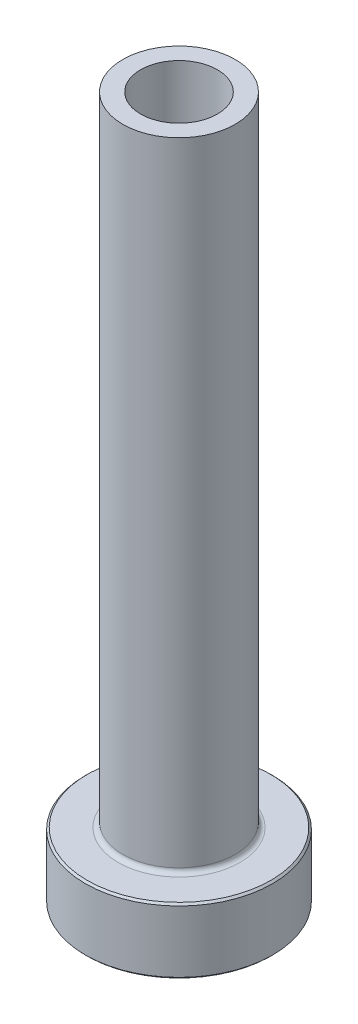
from build123d import *

# Parameters (mm, degrees)
FILLET1_R     = 0.5
CHAMFER1_SIZE = 0.2
CHAMFER3_SIZE = 0.5


with BuildPart() as part:
    # Sketch1 → Revolve1 (revolve)
    with BuildSketch(Plane.XY, mode=Mode.PRIVATE) as revolve1_sk:
        Polygon((-4.1, 75), (-6, 75), (-6, 7), (-10, 7), (-10, 0), (-4.35, 0), (-4.35, 18), (-4.1, 30), align=None)
    revolve(revolve1_sk.sketch.rotate(Axis((0, 92.187680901, 0), (0, -1, 0)), 270), axis=Axis((0, 92.187680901, 0), (0, -1, 0)))

    # Fillet1
    fillet1_edges = [part.edges().sort_by_distance(p)[0] for p in [
        (0, 7, -6),
    ]]
    fillet(fillet1_edges, radius=FILLET1_R)

    # Chamfer1
    chamfer1_edges = [part.edges().sort_by_distance(p)[0] for p in [
        (0, 0, -10),
        (0, 7, -10),
    ]]
    chamfer(chamfer1_edges, length=CHAMFER1_SIZE)

    # Chamfer3
    chamfer3_edges = [part.edges().sort_by_distance(p)[0] for p in [
        (0, 0, -4.35),
    ]]
    chamfer(chamfer3_edges, length=CHAMFER3_SIZE)


solid = part.part
